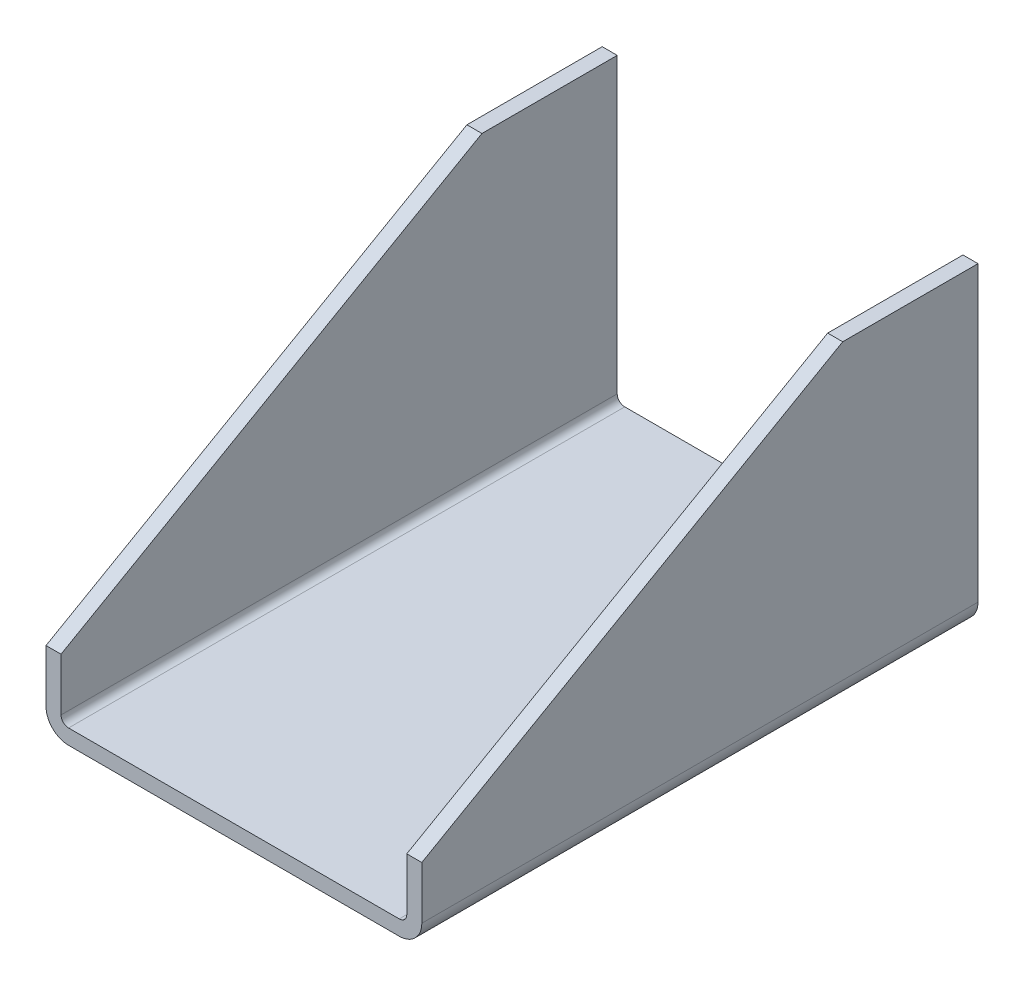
ISO-10303-21;
HEADER;
FILE_DESCRIPTION(('STEP AP214'),'2;1');
FILE_NAME('part.step','',(''),(''),'','','');
FILE_SCHEMA(('AUTOMOTIVE_DESIGN { 1 0 10303 214 1 1 1 1 }'));
ENDSEC;
DATA;
#1=APPLICATION_CONTEXT('core data for automotive mechanical design processes');
#2=APPLICATION_PROTOCOL_DEFINITION('international standard','automotive_design',2000,#1);
#3=PRODUCT_CONTEXT('',#1,'mechanical');
#4=PRODUCT('Part','Part','',(#3));
#5=PRODUCT_RELATED_PRODUCT_CATEGORY('part','',(#4));
#6=PRODUCT_DEFINITION_FORMATION('','',#4);
#7=PRODUCT_DEFINITION_CONTEXT('part definition',#1,'design');
#8=PRODUCT_DEFINITION('design','',#6,#7);
#9=PRODUCT_DEFINITION_SHAPE('','',#8);
#10=(LENGTH_UNIT() NAMED_UNIT(*) SI_UNIT(.MILLI.,.METRE.));
#11=(NAMED_UNIT(*) PLANE_ANGLE_UNIT() SI_UNIT($,.RADIAN.));
#12=(NAMED_UNIT(*) SI_UNIT($,.STERADIAN.) SOLID_ANGLE_UNIT());
#13=UNCERTAINTY_MEASURE_WITH_UNIT(LENGTH_MEASURE(1.E-05),#10,'distance_accuracy_value','');
#14=(GEOMETRIC_REPRESENTATION_CONTEXT(3) GLOBAL_UNCERTAINTY_ASSIGNED_CONTEXT((#13)) GLOBAL_UNIT_ASSIGNED_CONTEXT((#10,
#11,#12)) REPRESENTATION_CONTEXT('',''));
#15=CARTESIAN_POINT('',(0.,0.,0.));
#16=DIRECTION('',(0.,0.,1.));
#17=DIRECTION('',(1.,0.,0.));
#18=AXIS2_PLACEMENT_3D('',#15,#16,#17);
#19=CARTESIAN_POINT('',(188.959129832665,-134.079320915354,370.));
#20=DIRECTION('',(0.,-0.868243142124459,-0.496138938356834));
#21=DIRECTION('',(0.,0.496138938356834,-0.868243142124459));
#22=AXIS2_PLACEMENT_3D('',#19,#20,#21);
#23=PLANE('',#22);
#24=DIRECTION('',(1.,0.,0.));
#25=VECTOR('',#24,1.);
#26=CARTESIAN_POINT('',(63.9591298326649,-134.079320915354,370.));
#27=LINE('',#26,#25);
#28=CARTESIAN_POINT('',(188.959129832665,-134.079320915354,370.));
#29=VERTEX_POINT('',#28);
#30=CARTESIAN_POINT('',(178.959129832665,-134.079320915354,370.));
#31=VERTEX_POINT('',#30);
#32=EDGE_CURVE('E175',#29,#31,#27,.F.);
#33=ORIENTED_EDGE('',*,*,#32,.F.);
#34=DIRECTION('',(0.,-0.496138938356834,0.868243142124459));
#35=VECTOR('',#34,1.);
#36=CARTESIAN_POINT('',(188.959129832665,25.9206790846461,90.));
#37=LINE('',#36,#35);
#38=CARTESIAN_POINT('',(188.959129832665,25.9206790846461,90.));
#39=VERTEX_POINT('',#38);
#40=EDGE_CURVE('E226',#39,#29,#37,.T.);
#41=ORIENTED_EDGE('',*,*,#40,.F.);
#42=DIRECTION('',(1.,0.,0.));
#43=VECTOR('',#42,1.);
#44=CARTESIAN_POINT('',(178.959129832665,25.9206790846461,90.));
#45=LINE('',#44,#43);
#46=CARTESIAN_POINT('',(178.959129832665,25.9206790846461,89.9999999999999));
#47=VERTEX_POINT('',#46);
#48=EDGE_CURVE('E220',#47,#39,#45,.T.);
#49=ORIENTED_EDGE('',*,*,#48,.F.);
#50=DIRECTION('',(0.,0.496138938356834,-0.868243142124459));
#51=VECTOR('',#50,1.);
#52=CARTESIAN_POINT('',(178.959129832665,-134.079320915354,370.));
#53=LINE('',#52,#51);
#54=EDGE_CURVE('E210',#31,#47,#53,.T.);
#55=ORIENTED_EDGE('',*,*,#54,.F.);
#56=EDGE_LOOP('',(#33,#41,#49,#55));
#57=FACE_BOUND('',#56,.T.);
#58=ADVANCED_FACE('F16',(#57),#23,.F.);
#59=CARTESIAN_POINT('',(188.959129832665,-134.079320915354,370.));
#60=DIRECTION('',(0.,-0.868243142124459,-0.496138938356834));
#61=DIRECTION('',(0.,0.496138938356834,-0.868243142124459));
#62=AXIS2_PLACEMENT_3D('',#59,#60,#61);
#63=PLANE('',#62);
#64=DIRECTION('',(1.,0.,0.));
#65=VECTOR('',#64,1.);
#66=CARTESIAN_POINT('',(-61.0408701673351,25.9206790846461,90.));
#67=LINE('',#66,#65);
#68=CARTESIAN_POINT('',(-61.0408701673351,25.9206790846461,89.9999999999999));
#69=VERTEX_POINT('',#68);
#70=CARTESIAN_POINT('',(-51.0408701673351,25.9206790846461,90.));
#71=VERTEX_POINT('',#70);
#72=EDGE_CURVE('E248',#69,#71,#67,.T.);
#73=ORIENTED_EDGE('',*,*,#72,.F.);
#74=DIRECTION('',(0.,0.496138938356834,-0.868243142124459));
#75=VECTOR('',#74,1.);
#76=CARTESIAN_POINT('',(-61.040870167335,-134.079320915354,370.));
#77=LINE('',#76,#75);
#78=CARTESIAN_POINT('',(-61.0408701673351,-134.079320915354,370.));
#79=VERTEX_POINT('',#78);
#80=EDGE_CURVE('E91',#79,#69,#77,.T.);
#81=ORIENTED_EDGE('',*,*,#80,.F.);
#82=DIRECTION('',(1.,0.,0.));
#83=VECTOR('',#82,1.);
#84=CARTESIAN_POINT('',(63.9591298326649,-134.079320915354,370.));
#85=LINE('',#84,#83);
#86=CARTESIAN_POINT('',(-51.0408701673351,-134.079320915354,370.));
#87=VERTEX_POINT('',#86);
#88=EDGE_CURVE('E166',#87,#79,#85,.F.);
#89=ORIENTED_EDGE('',*,*,#88,.F.);
#90=DIRECTION('',(0.,-0.496138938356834,0.868243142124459));
#91=VECTOR('',#90,1.);
#92=CARTESIAN_POINT('',(-51.0408701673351,25.9206790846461,90.));
#93=LINE('',#92,#91);
#94=EDGE_CURVE('E200',#71,#87,#93,.T.);
#95=ORIENTED_EDGE('',*,*,#94,.F.);
#96=EDGE_LOOP('',(#73,#81,#89,#95));
#97=FACE_BOUND('',#96,.T.);
#98=ADVANCED_FACE('F298',(#97),#63,.F.);
#99=CARTESIAN_POINT('',(-61.0408701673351,25.9206790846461,0.));
#100=DIRECTION('',(0.,1.,0.));
#101=DIRECTION('',(0.,0.,1.));
#102=AXIS2_PLACEMENT_3D('',#99,#100,#101);
#103=PLANE('',#102);
#104=DIRECTION('',(1.,0.,0.));
#105=VECTOR('',#104,1.);
#106=CARTESIAN_POINT('',(63.9591298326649,25.9206790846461,0.));
#107=LINE('',#106,#105);
#108=CARTESIAN_POINT('',(-51.0408701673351,25.9206790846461,0.));
#109=VERTEX_POINT('',#108);
#110=CARTESIAN_POINT('',(-61.0408701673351,25.9206790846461,0.));
#111=VERTEX_POINT('',#110);
#112=EDGE_CURVE('E126',#109,#111,#107,.F.);
#113=ORIENTED_EDGE('',*,*,#112,.T.);
#114=DIRECTION('',(0.,0.,1.));
#115=VECTOR('',#114,1.);
#116=CARTESIAN_POINT('',(-61.040870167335,25.9206790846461,0.));
#117=LINE('',#116,#115);
#118=EDGE_CURVE('E234',#69,#111,#117,.F.);
#119=ORIENTED_EDGE('',*,*,#118,.F.);
#120=ORIENTED_EDGE('',*,*,#72,.T.);
#121=DIRECTION('',(0.,0.,-1.));
#122=VECTOR('',#121,1.);
#123=CARTESIAN_POINT('',(-51.0408701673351,25.9206790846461,0.));
#124=LINE('',#123,#122);
#125=EDGE_CURVE('E198',#109,#71,#124,.F.);
#126=ORIENTED_EDGE('',*,*,#125,.F.);
#127=EDGE_LOOP('',(#113,#119,#120,#126));
#128=FACE_BOUND('',#127,.T.);
#129=ADVANCED_FACE('F288',(#128),#103,.T.);
#130=CARTESIAN_POINT('',(-61.040870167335,-169.079320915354,0.));
#131=DIRECTION('',(-1.,0.,0.));
#132=DIRECTION('',(0.,0.,1.));
#133=AXIS2_PLACEMENT_3D('',#130,#131,#132);
#134=PLANE('',#133);
#135=DIRECTION('',(0.,0.,1.));
#136=VECTOR('',#135,1.);
#137=CARTESIAN_POINT('',(-61.040870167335,-169.079320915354,0.));
#138=LINE('',#137,#136);
#139=CARTESIAN_POINT('',(-61.0408701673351,-169.079320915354,370.));
#140=VERTEX_POINT('',#139);
#141=CARTESIAN_POINT('',(-61.0408701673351,-169.079320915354,0.));
#142=VERTEX_POINT('',#141);
#143=EDGE_CURVE('E81',#140,#142,#138,.F.);
#144=ORIENTED_EDGE('',*,*,#143,.F.);
#145=DIRECTION('',(0.,1.,0.));
#146=VECTOR('',#145,1.);
#147=CARTESIAN_POINT('',(-61.0408701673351,-111.465831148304,370.));
#148=LINE('',#147,#146);
#149=EDGE_CURVE('E160',#79,#140,#148,.F.);
#150=ORIENTED_EDGE('',*,*,#149,.F.);
#151=ORIENTED_EDGE('',*,*,#80,.T.);
#152=ORIENTED_EDGE('',*,*,#118,.T.);
#153=DIRECTION('',(0.,1.,0.));
#154=VECTOR('',#153,1.);
#155=CARTESIAN_POINT('',(-61.0408701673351,-111.465831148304,0.));
#156=LINE('',#155,#154);
#157=EDGE_CURVE('E145',#111,#142,#156,.F.);
#158=ORIENTED_EDGE('',*,*,#157,.T.);
#159=EDGE_LOOP('',(#144,#150,#151,#152,#158));
#160=FACE_BOUND('',#159,.T.);
#161=ADVANCED_FACE('F289',(#160),#134,.T.);
#162=CARTESIAN_POINT('',(-46.040870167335,-169.079320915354,0.));
#163=DIRECTION('',(0.,0.,1.));
#164=DIRECTION('',(1.,0.,0.));
#165=AXIS2_PLACEMENT_3D('',#162,#163,#164);
#166=CYLINDRICAL_SURFACE('',#165,15.);
#167=CARTESIAN_POINT('',(-46.040870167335,-169.079320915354,0.));
#168=DIRECTION('',(0.,0.,1.));
#169=DIRECTION('',(1.,0.,0.));
#170=AXIS2_PLACEMENT_3D('',#167,#168,#169);
#171=CIRCLE('',#170,15.);
#172=CARTESIAN_POINT('',(-46.040870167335,-184.079320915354,0.));
#173=VERTEX_POINT('',#172);
#174=EDGE_CURVE('E143',#142,#173,#171,.T.);
#175=ORIENTED_EDGE('',*,*,#174,.T.);
#176=DIRECTION('',(0.,0.,-1.));
#177=VECTOR('',#176,1.);
#178=CARTESIAN_POINT('',(-46.040870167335,-184.079320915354,0.));
#179=LINE('',#178,#177);
#180=CARTESIAN_POINT('',(-46.040870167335,-184.079320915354,370.));
#181=VERTEX_POINT('',#180);
#182=EDGE_CURVE('E230',#181,#173,#179,.T.);
#183=ORIENTED_EDGE('',*,*,#182,.F.);
#184=CARTESIAN_POINT('',(-46.040870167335,-169.079320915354,370.));
#185=DIRECTION('',(0.,0.,1.));
#186=DIRECTION('',(1.,0.,0.));
#187=AXIS2_PLACEMENT_3D('',#184,#185,#186);
#188=CIRCLE('',#187,15.);
#189=EDGE_CURVE('E20',#140,#181,#188,.T.);
#190=ORIENTED_EDGE('',*,*,#189,.F.);
#191=ORIENTED_EDGE('',*,*,#143,.T.);
#192=EDGE_LOOP('',(#175,#183,#190,#191));
#193=FACE_BOUND('',#192,.T.);
#194=ADVANCED_FACE('F294',(#193),#166,.T.);
#195=CARTESIAN_POINT('',(173.959129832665,-184.079320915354,0.));
#196=DIRECTION('',(0.,-1.,0.));
#197=DIRECTION('',(0.,0.,-1.));
#198=AXIS2_PLACEMENT_3D('',#195,#196,#197);
#199=PLANE('',#198);
#200=DIRECTION('',(1.,0.,0.));
#201=VECTOR('',#200,1.);
#202=CARTESIAN_POINT('',(63.9591298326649,-184.079320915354,0.));
#203=LINE('',#202,#201);
#204=CARTESIAN_POINT('',(173.959129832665,-184.079320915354,0.));
#205=VERTEX_POINT('',#204);
#206=EDGE_CURVE('E142',#173,#205,#203,.T.);
#207=ORIENTED_EDGE('',*,*,#206,.T.);
#208=DIRECTION('',(0.,0.,1.));
#209=VECTOR('',#208,1.);
#210=CARTESIAN_POINT('',(173.959129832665,-184.079320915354,0.));
#211=LINE('',#210,#209);
#212=CARTESIAN_POINT('',(173.959129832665,-184.079320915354,370.));
#213=VERTEX_POINT('',#212);
#214=EDGE_CURVE('E227',#213,#205,#211,.F.);
#215=ORIENTED_EDGE('',*,*,#214,.F.);
#216=DIRECTION('',(1.,0.,0.));
#217=VECTOR('',#216,1.);
#218=CARTESIAN_POINT('',(63.9591298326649,-184.079320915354,370.));
#219=LINE('',#218,#217);
#220=EDGE_CURVE('E151',#181,#213,#219,.T.);
#221=ORIENTED_EDGE('',*,*,#220,.F.);
#222=ORIENTED_EDGE('',*,*,#182,.T.);
#223=EDGE_LOOP('',(#207,#215,#221,#222));
#224=FACE_BOUND('',#223,.T.);
#225=ADVANCED_FACE('F296',(#224),#199,.T.);
#226=CARTESIAN_POINT('',(173.959129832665,-169.079320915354,0.));
#227=DIRECTION('',(0.,0.,1.));
#228=DIRECTION('',(1.,0.,0.));
#229=AXIS2_PLACEMENT_3D('',#226,#227,#228);
#230=CYLINDRICAL_SURFACE('',#229,15.);
#231=CARTESIAN_POINT('',(173.959129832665,-169.079320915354,0.));
#232=DIRECTION('',(0.,0.,1.));
#233=DIRECTION('',(1.,0.,0.));
#234=AXIS2_PLACEMENT_3D('',#231,#232,#233);
#235=CIRCLE('',#234,15.);
#236=CARTESIAN_POINT('',(188.959129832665,-169.079320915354,0.));
#237=VERTEX_POINT('',#236);
#238=EDGE_CURVE('E139',#205,#237,#235,.T.);
#239=ORIENTED_EDGE('',*,*,#238,.T.);
#240=DIRECTION('',(0.,0.,-1.));
#241=VECTOR('',#240,1.);
#242=CARTESIAN_POINT('',(188.959129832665,-169.079320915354,0.));
#243=LINE('',#242,#241);
#244=CARTESIAN_POINT('',(188.959129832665,-169.079320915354,370.));
#245=VERTEX_POINT('',#244);
#246=EDGE_CURVE('E223',#245,#237,#243,.T.);
#247=ORIENTED_EDGE('',*,*,#246,.F.);
#248=CARTESIAN_POINT('',(173.959129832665,-169.079320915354,370.));
#249=DIRECTION('',(0.,0.,1.));
#250=DIRECTION('',(1.,0.,0.));
#251=AXIS2_PLACEMENT_3D('',#248,#249,#250);
#252=CIRCLE('',#251,15.);
#253=EDGE_CURVE('E148',#213,#245,#252,.T.);
#254=ORIENTED_EDGE('',*,*,#253,.F.);
#255=ORIENTED_EDGE('',*,*,#214,.T.);
#256=EDGE_LOOP('',(#239,#247,#254,#255));
#257=FACE_BOUND('',#256,.T.);
#258=ADVANCED_FACE('F325',(#257),#230,.T.);
#259=CARTESIAN_POINT('',(188.959129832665,25.9206790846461,0.));
#260=DIRECTION('',(1.,0.,0.));
#261=DIRECTION('',(0.,0.,-1.));
#262=AXIS2_PLACEMENT_3D('',#259,#260,#261);
#263=PLANE('',#262);
#264=DIRECTION('',(0.,1.,0.));
#265=VECTOR('',#264,1.);
#266=CARTESIAN_POINT('',(188.959129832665,-111.465831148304,0.));
#267=LINE('',#266,#265);
#268=CARTESIAN_POINT('',(188.959129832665,25.9206790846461,0.));
#269=VERTEX_POINT('',#268);
#270=EDGE_CURVE('E141',#237,#269,#267,.T.);
#271=ORIENTED_EDGE('',*,*,#270,.T.);
#272=DIRECTION('',(0.,0.,1.));
#273=VECTOR('',#272,1.);
#274=CARTESIAN_POINT('',(188.959129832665,25.9206790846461,0.));
#275=LINE('',#274,#273);
#276=EDGE_CURVE('E217',#39,#269,#275,.F.);
#277=ORIENTED_EDGE('',*,*,#276,.F.);
#278=ORIENTED_EDGE('',*,*,#40,.T.);
#279=DIRECTION('',(0.,1.,0.));
#280=VECTOR('',#279,1.);
#281=CARTESIAN_POINT('',(188.959129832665,-111.465831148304,370.));
#282=LINE('',#281,#280);
#283=EDGE_CURVE('E150',#245,#29,#282,.T.);
#284=ORIENTED_EDGE('',*,*,#283,.F.);
#285=ORIENTED_EDGE('',*,*,#246,.T.);
#286=EDGE_LOOP('',(#271,#277,#278,#284,#285));
#287=FACE_BOUND('',#286,.T.);
#288=ADVANCED_FACE('F322',(#287),#263,.T.);
#289=CARTESIAN_POINT('',(178.959129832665,25.9206790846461,0.));
#290=DIRECTION('',(0.,1.,0.));
#291=DIRECTION('',(0.,0.,1.));
#292=AXIS2_PLACEMENT_3D('',#289,#290,#291);
#293=PLANE('',#292);
#294=DIRECTION('',(1.,0.,0.));
#295=VECTOR('',#294,1.);
#296=CARTESIAN_POINT('',(63.9591298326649,25.9206790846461,0.));
#297=LINE('',#296,#295);
#298=CARTESIAN_POINT('',(178.959129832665,25.9206790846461,0.));
#299=VERTEX_POINT('',#298);
#300=EDGE_CURVE('E181',#269,#299,#297,.F.);
#301=ORIENTED_EDGE('',*,*,#300,.T.);
#302=DIRECTION('',(0.,0.,1.));
#303=VECTOR('',#302,1.);
#304=CARTESIAN_POINT('',(178.959129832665,25.9206790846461,0.));
#305=LINE('',#304,#303);
#306=EDGE_CURVE('E207',#47,#299,#305,.F.);
#307=ORIENTED_EDGE('',*,*,#306,.F.);
#308=ORIENTED_EDGE('',*,*,#48,.T.);
#309=ORIENTED_EDGE('',*,*,#276,.T.);
#310=EDGE_LOOP('',(#301,#307,#308,#309));
#311=FACE_BOUND('',#310,.T.);
#312=ADVANCED_FACE('F271',(#311),#293,.T.);
#313=CARTESIAN_POINT('',(178.959129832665,-169.079320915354,0.));
#314=DIRECTION('',(-1.,0.,0.));
#315=DIRECTION('',(0.,0.,1.));
#316=AXIS2_PLACEMENT_3D('',#313,#314,#315);
#317=PLANE('',#316);
#318=DIRECTION('',(0.,0.,1.));
#319=VECTOR('',#318,1.);
#320=CARTESIAN_POINT('',(178.959129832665,-169.079320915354,0.));
#321=LINE('',#320,#319);
#322=CARTESIAN_POINT('',(178.959129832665,-169.079320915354,0.));
#323=VERTEX_POINT('',#322);
#324=CARTESIAN_POINT('',(178.959129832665,-169.079320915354,370.));
#325=VERTEX_POINT('',#324);
#326=EDGE_CURVE('E147',#323,#325,#321,.T.);
#327=ORIENTED_EDGE('',*,*,#326,.T.);
#328=DIRECTION('',(0.,1.,0.));
#329=VECTOR('',#328,1.);
#330=CARTESIAN_POINT('',(178.959129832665,-111.465831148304,370.));
#331=LINE('',#330,#329);
#332=EDGE_CURVE('E170',#31,#325,#331,.F.);
#333=ORIENTED_EDGE('',*,*,#332,.F.);
#334=ORIENTED_EDGE('',*,*,#54,.T.);
#335=ORIENTED_EDGE('',*,*,#306,.T.);
#336=DIRECTION('',(0.,1.,0.));
#337=VECTOR('',#336,1.);
#338=CARTESIAN_POINT('',(178.959129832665,-111.465831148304,0.));
#339=LINE('',#338,#337);
#340=EDGE_CURVE('E138',#299,#323,#339,.F.);
#341=ORIENTED_EDGE('',*,*,#340,.T.);
#342=EDGE_LOOP('',(#327,#333,#334,#335,#341));
#343=FACE_BOUND('',#342,.T.);
#344=ADVANCED_FACE('F319',(#343),#317,.T.);
#345=CARTESIAN_POINT('',(-51.0408701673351,25.9206790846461,0.));
#346=DIRECTION('',(1.,0.,0.));
#347=DIRECTION('',(0.,0.,-1.));
#348=AXIS2_PLACEMENT_3D('',#345,#346,#347);
#349=PLANE('',#348);
#350=DIRECTION('',(0.,1.,0.));
#351=VECTOR('',#350,1.);
#352=CARTESIAN_POINT('',(-51.0408701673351,-111.465831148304,0.));
#353=LINE('',#352,#351);
#354=CARTESIAN_POINT('',(-51.0408701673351,-169.079320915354,0.));
#355=VERTEX_POINT('',#354);
#356=EDGE_CURVE('E118',#355,#109,#353,.T.);
#357=ORIENTED_EDGE('',*,*,#356,.T.);
#358=ORIENTED_EDGE('',*,*,#125,.T.);
#359=ORIENTED_EDGE('',*,*,#94,.T.);
#360=DIRECTION('',(0.,1.,0.));
#361=VECTOR('',#360,1.);
#362=CARTESIAN_POINT('',(-51.0408701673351,-111.465831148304,370.));
#363=LINE('',#362,#361);
#364=CARTESIAN_POINT('',(-51.0408701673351,-169.079320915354,370.));
#365=VERTEX_POINT('',#364);
#366=EDGE_CURVE('E111',#365,#87,#363,.T.);
#367=ORIENTED_EDGE('',*,*,#366,.F.);
#368=DIRECTION('',(0.,0.,1.));
#369=VECTOR('',#368,1.);
#370=CARTESIAN_POINT('',(-51.0408701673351,-169.079320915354,0.));
#371=LINE('',#370,#369);
#372=EDGE_CURVE('E115',#365,#355,#371,.F.);
#373=ORIENTED_EDGE('',*,*,#372,.T.);
#374=EDGE_LOOP('',(#357,#358,#359,#367,#373));
#375=FACE_BOUND('',#374,.T.);
#376=ADVANCED_FACE('F116',(#375),#349,.T.);
#377=CARTESIAN_POINT('',(63.9591298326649,-111.465831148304,370.));
#378=DIRECTION('',(0.,0.,1.));
#379=DIRECTION('',(1.,0.,0.));
#380=AXIS2_PLACEMENT_3D('',#377,#378,#379);
#381=PLANE('',#380);
#382=ORIENTED_EDGE('',*,*,#253,.T.);
#383=ORIENTED_EDGE('',*,*,#283,.T.);
#384=ORIENTED_EDGE('',*,*,#32,.T.);
#385=ORIENTED_EDGE('',*,*,#332,.T.);
#386=CARTESIAN_POINT('',(173.959129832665,-169.079320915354,370.));
#387=DIRECTION('',(0.,0.,1.));
#388=DIRECTION('',(1.,0.,0.));
#389=AXIS2_PLACEMENT_3D('',#386,#387,#388);
#390=CIRCLE('',#389,5.);
#391=CARTESIAN_POINT('',(173.959129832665,-174.079320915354,370.));
#392=VERTEX_POINT('',#391);
#393=EDGE_CURVE('E146',#325,#392,#390,.F.);
#394=ORIENTED_EDGE('',*,*,#393,.T.);
#395=DIRECTION('',(1.,0.,0.));
#396=VECTOR('',#395,1.);
#397=CARTESIAN_POINT('',(-46.0408701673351,-174.079320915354,370.));
#398=LINE('',#397,#396);
#399=CARTESIAN_POINT('',(-46.0408701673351,-174.079320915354,370.));
#400=VERTEX_POINT('',#399);
#401=EDGE_CURVE('E133',#400,#392,#398,.T.);
#402=ORIENTED_EDGE('',*,*,#401,.F.);
#403=CARTESIAN_POINT('',(-46.0408701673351,-169.079320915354,370.));
#404=DIRECTION('',(0.,0.,1.));
#405=DIRECTION('',(1.,0.,0.));
#406=AXIS2_PLACEMENT_3D('',#403,#404,#405);
#407=CIRCLE('',#406,5.);
#408=EDGE_CURVE('E131',#400,#365,#407,.F.);
#409=ORIENTED_EDGE('',*,*,#408,.T.);
#410=ORIENTED_EDGE('',*,*,#366,.T.);
#411=ORIENTED_EDGE('',*,*,#88,.T.);
#412=ORIENTED_EDGE('',*,*,#149,.T.);
#413=ORIENTED_EDGE('',*,*,#189,.T.);
#414=ORIENTED_EDGE('',*,*,#220,.T.);
#415=EDGE_LOOP('',(#382,#383,#384,#385,#394,#402,#409,#410,#411,#412,#413,#414));
#416=FACE_BOUND('',#415,.T.);
#417=ADVANCED_FACE('F297',(#416),#381,.T.);
#418=CARTESIAN_POINT('',(173.959129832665,-169.079320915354,0.));
#419=DIRECTION('',(0.,0.,1.));
#420=DIRECTION('',(1.,0.,0.));
#421=AXIS2_PLACEMENT_3D('',#418,#419,#420);
#422=CYLINDRICAL_SURFACE('',#421,5.);
#423=ORIENTED_EDGE('',*,*,#326,.F.);
#424=CARTESIAN_POINT('',(173.959129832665,-169.079320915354,0.));
#425=DIRECTION('',(0.,0.,1.));
#426=DIRECTION('',(1.,0.,0.));
#427=AXIS2_PLACEMENT_3D('',#424,#425,#426);
#428=CIRCLE('',#427,5.);
#429=CARTESIAN_POINT('',(173.959129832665,-174.079320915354,0.));
#430=VERTEX_POINT('',#429);
#431=EDGE_CURVE('E127',#323,#430,#428,.F.);
#432=ORIENTED_EDGE('',*,*,#431,.T.);
#433=DIRECTION('',(0.,0.,1.));
#434=VECTOR('',#433,1.);
#435=CARTESIAN_POINT('',(173.959129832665,-174.079320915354,0.));
#436=LINE('',#435,#434);
#437=EDGE_CURVE('E192',#392,#430,#436,.F.);
#438=ORIENTED_EDGE('',*,*,#437,.F.);
#439=ORIENTED_EDGE('',*,*,#393,.F.);
#440=EDGE_LOOP('',(#423,#432,#438,#439));
#441=FACE_BOUND('',#440,.T.);
#442=ADVANCED_FACE('F316',(#441),#422,.F.);
#443=CARTESIAN_POINT('',(63.9591298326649,-111.465831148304,0.));
#444=DIRECTION('',(0.,0.,1.));
#445=DIRECTION('',(1.,0.,0.));
#446=AXIS2_PLACEMENT_3D('',#443,#444,#445);
#447=PLANE('',#446);
#448=CARTESIAN_POINT('',(-46.0408701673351,-169.079320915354,0.));
#449=DIRECTION('',(0.,0.,1.));
#450=DIRECTION('',(1.,0.,0.));
#451=AXIS2_PLACEMENT_3D('',#448,#449,#450);
#452=CIRCLE('',#451,5.);
#453=CARTESIAN_POINT('',(-46.0408701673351,-174.079320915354,0.));
#454=VERTEX_POINT('',#453);
#455=EDGE_CURVE('E35',#355,#454,#452,.T.);
#456=ORIENTED_EDGE('',*,*,#455,.T.);
#457=DIRECTION('',(1.,0.,0.));
#458=VECTOR('',#457,1.);
#459=CARTESIAN_POINT('',(-46.0408701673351,-174.079320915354,0.));
#460=LINE('',#459,#458);
#461=EDGE_CURVE('E26',#430,#454,#460,.F.);
#462=ORIENTED_EDGE('',*,*,#461,.F.);
#463=ORIENTED_EDGE('',*,*,#431,.F.);
#464=ORIENTED_EDGE('',*,*,#340,.F.);
#465=ORIENTED_EDGE('',*,*,#300,.F.);
#466=ORIENTED_EDGE('',*,*,#270,.F.);
#467=ORIENTED_EDGE('',*,*,#238,.F.);
#468=ORIENTED_EDGE('',*,*,#206,.F.);
#469=ORIENTED_EDGE('',*,*,#174,.F.);
#470=ORIENTED_EDGE('',*,*,#157,.F.);
#471=ORIENTED_EDGE('',*,*,#112,.F.);
#472=ORIENTED_EDGE('',*,*,#356,.F.);
#473=EDGE_LOOP('',(#456,#462,#463,#464,#465,#466,#467,#468,#469,#470,#471,#472));
#474=FACE_BOUND('',#473,.T.);
#475=ADVANCED_FACE('F123',(#474),#447,.F.);
#476=CARTESIAN_POINT('',(-46.0408701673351,-169.079320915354,0.));
#477=DIRECTION('',(0.,0.,1.));
#478=DIRECTION('',(1.,0.,0.));
#479=AXIS2_PLACEMENT_3D('',#476,#477,#478);
#480=CYLINDRICAL_SURFACE('',#479,5.);
#481=DIRECTION('',(0.,0.,1.));
#482=VECTOR('',#481,1.);
#483=CARTESIAN_POINT('',(-46.0408701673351,-174.079320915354,0.));
#484=LINE('',#483,#482);
#485=EDGE_CURVE('E10',#454,#400,#484,.T.);
#486=ORIENTED_EDGE('',*,*,#485,.F.);
#487=ORIENTED_EDGE('',*,*,#455,.F.);
#488=ORIENTED_EDGE('',*,*,#372,.F.);
#489=ORIENTED_EDGE('',*,*,#408,.F.);
#490=EDGE_LOOP('',(#486,#487,#488,#489));
#491=FACE_BOUND('',#490,.T.);
#492=ADVANCED_FACE('F129',(#491),#480,.F.);
#493=CARTESIAN_POINT('',(-46.0408701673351,-174.079320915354,0.));
#494=DIRECTION('',(0.,1.,0.));
#495=DIRECTION('',(0.,0.,1.));
#496=AXIS2_PLACEMENT_3D('',#493,#494,#495);
#497=PLANE('',#496);
#498=ORIENTED_EDGE('',*,*,#461,.T.);
#499=ORIENTED_EDGE('',*,*,#485,.T.);
#500=ORIENTED_EDGE('',*,*,#401,.T.);
#501=ORIENTED_EDGE('',*,*,#437,.T.);
#502=EDGE_LOOP('',(#498,#499,#500,#501));
#503=FACE_BOUND('',#502,.T.);
#504=ADVANCED_FACE('F18',(#503),#497,.T.);
#505=CLOSED_SHELL('',(#58,#98,#129,#161,#194,#225,#258,#288,#312,#344,#376,#417,#442,#475,#492,#504));
#506=MANIFOLD_SOLID_BREP('B1',#505);
#507=ADVANCED_BREP_SHAPE_REPRESENTATION('',(#18,#506),#14);
#508=SHAPE_DEFINITION_REPRESENTATION(#9,#507);
ENDSEC;
END-ISO-10303-21;
